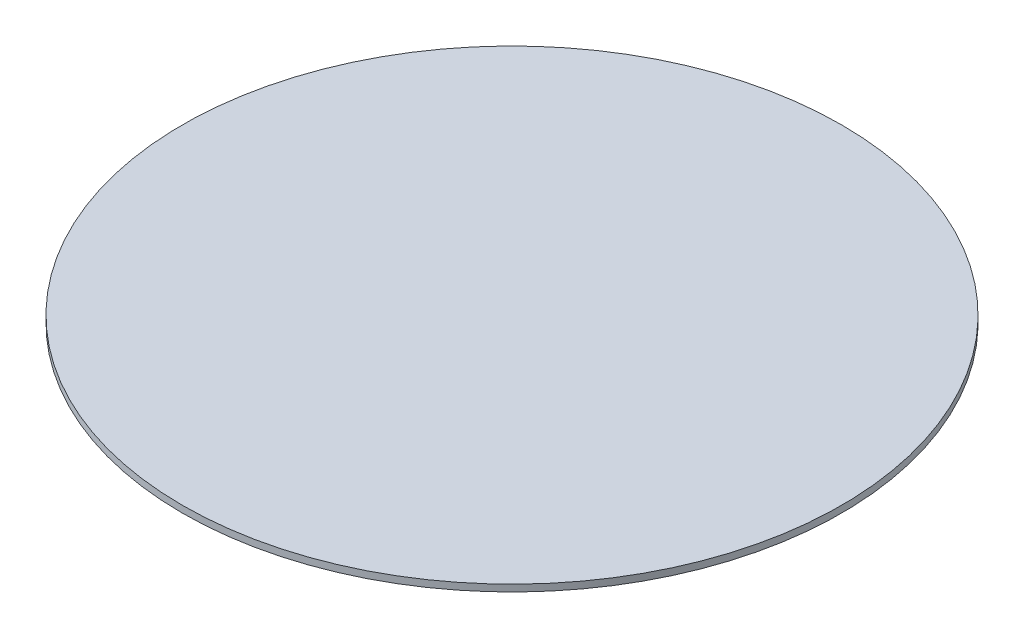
from build123d import *

# Parameters (mm, degrees)
CROQUIS4_R              = 97
SALIENTE_EXTRUIR1_DEPTH = 2


with BuildPart() as part:
    # Croquis4 → Saliente-Extruir1 (new body)
    with BuildSketch(Plane(origin=(0, 0, 0), x_dir=(1, 0, 0), z_dir=(0, 1, 0))):
        with Locations(Location((0, 0, 0), (0, 0, 270))):
            Circle(CROQUIS4_R)
    extrude(amount=SALIENTE_EXTRUIR1_DEPTH)


solid = part.part
